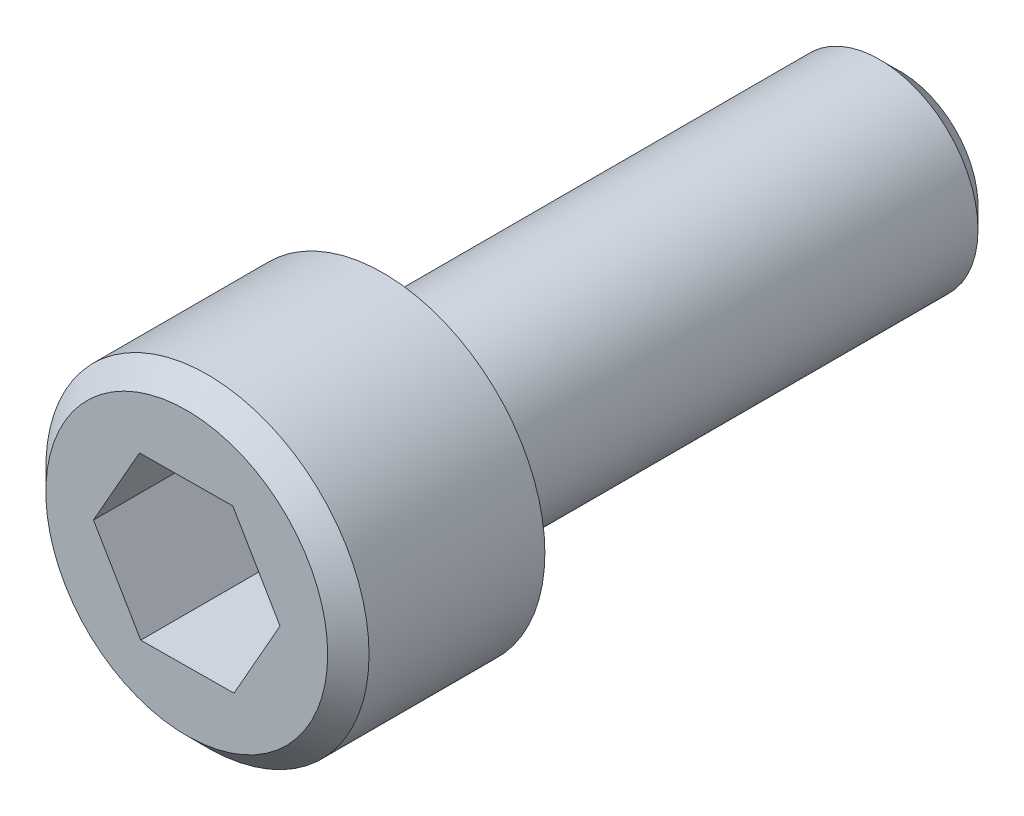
from build123d import *

# Parameters (mm, degrees)
SKETCH1_R           = 3.96875
HEAD_DEPTH          = 4.826
CHAMFER1_SIZE       = 0.508
CUT_EXTRUDE1_DEPTH  = 3.175
SKETCH3_R           = 2.413
BOSS_EXTRUDE1_DEPTH = 12.7
CHAMFER2_SIZE       = 0.508


with BuildPart() as part:
    # Sketch1 → Head (new body)
    with BuildSketch(Plane.XY):
        Circle(SKETCH1_R)
    extrude(amount=HEAD_DEPTH)

    # Chamfer1
    chamfer1_edges = [part.edges().sort_by_distance(p)[0] for p in [
        (-3.96875, 0, 4.826),
    ]]
    chamfer(chamfer1_edges, length=CHAMFER1_SIZE)

    # Sketch2 → Cut-Extrude1 (cut)
    with BuildSketch(Plane.XY.offset(4.826)):
        Polygon((-1.130030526, -1.992485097), (1.160527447, -1.974877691), (2.290557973, 0.017607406), (1.130030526, 1.992485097), (-1.160527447, 1.974877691), (-2.290557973, -0.017607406), align=None)
    extrude(amount=-CUT_EXTRUDE1_DEPTH, mode=Mode.SUBTRACT)

    # Sketch3 → Boss-Extrude1 (add)
    with BuildSketch(Plane(origin=(0, 0, 0), x_dir=(-1, 0, 0), z_dir=(0, 0, -1))):
        with Locations(Location((0, 0, 0), (0, 0, 180))):
            Circle(SKETCH3_R)
    extrude(amount=BOSS_EXTRUDE1_DEPTH)

    # Chamfer2
    chamfer2_edges = [part.edges().sort_by_distance(p)[0] for p in [
        (-2.413, 0, -12.7),
    ]]
    chamfer(chamfer2_edges, length=CHAMFER2_SIZE)


solid = part.part
